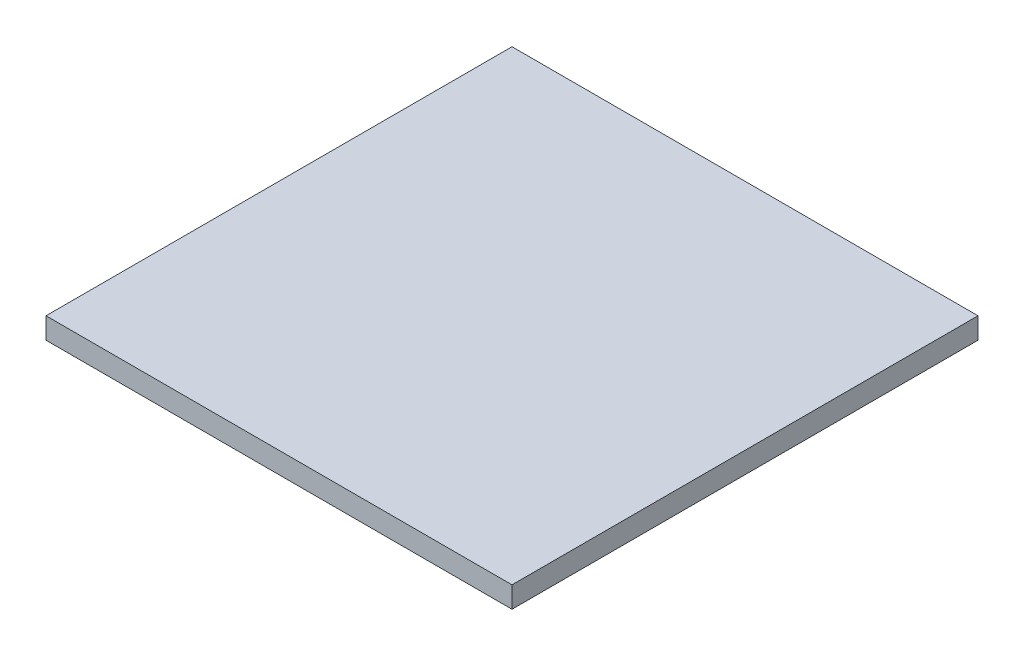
from build123d import *

# Parameters (mm, degrees)
SKETCH1_W           = 279.4
SKETCH1_H           = 279.4
BOSS_EXTRUDE1_DEPTH = 12.7


with BuildPart() as part:
    # Sketch1 → Boss-Extrude1 (new body)
    with BuildSketch(Plane(origin=(0, 0, 0), x_dir=(1, 0, 0), z_dir=(0, 1, 0))):
        with Locations((-139.7, 139.7)):
            Rectangle(SKETCH1_W, SKETCH1_H)
    extrude(amount=BOSS_EXTRUDE1_DEPTH)


solid = part.part
